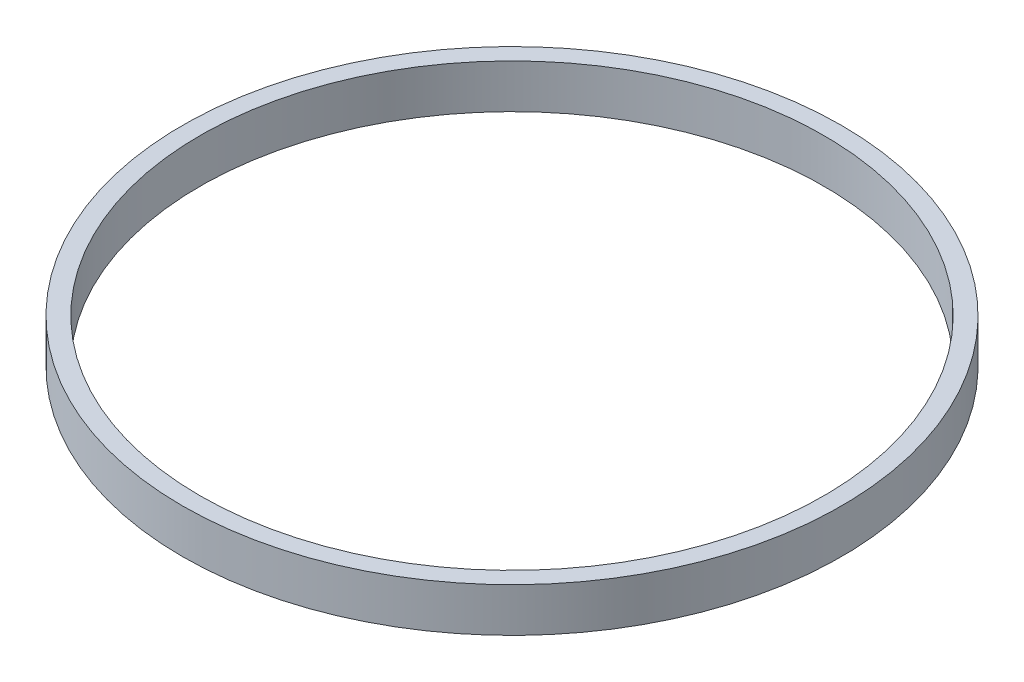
from build123d import *

# Parameters (mm, degrees)
SKETCH1_R           = 75
SKETCH1_R_2         = 71
BOSS_EXTRUDE1_DEPTH = 10


with BuildPart() as part:
    # Sketch1 → Boss-Extrude1 (new body)
    with BuildSketch(Plane(origin=(0, 0, 0), x_dir=(1, 0, 0), z_dir=(0, 1, 0))):
        with Locations(Location((0, 0, 0), (0, 0, 270))):
            Circle(SKETCH1_R)
        with Locations(Location((0, 0, 0), (0, 0, 270))):
            Circle(SKETCH1_R_2, mode=Mode.SUBTRACT)
    extrude(amount=BOSS_EXTRUDE1_DEPTH)


solid = part.part
